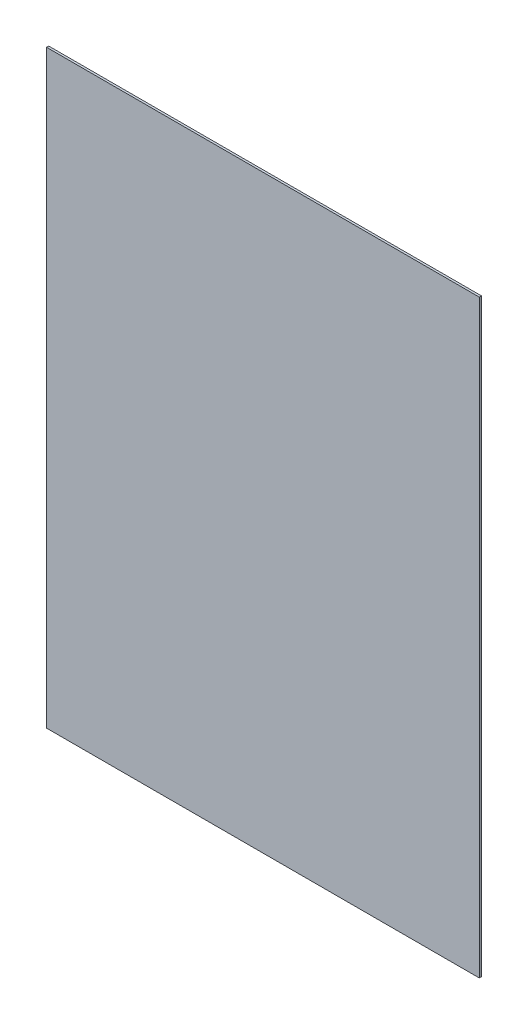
ISO-10303-21;
HEADER;
FILE_DESCRIPTION(('STEP AP214'),'2;1');
FILE_NAME('part.step','',(''),(''),'','','');
FILE_SCHEMA(('AUTOMOTIVE_DESIGN { 1 0 10303 214 1 1 1 1 }'));
ENDSEC;
DATA;
#1=APPLICATION_CONTEXT('core data for automotive mechanical design processes');
#2=APPLICATION_PROTOCOL_DEFINITION('international standard','automotive_design',2000,#1);
#3=PRODUCT_CONTEXT('',#1,'mechanical');
#4=PRODUCT('Part','Part','',(#3));
#5=PRODUCT_RELATED_PRODUCT_CATEGORY('part','',(#4));
#6=PRODUCT_DEFINITION_FORMATION('','',#4);
#7=PRODUCT_DEFINITION_CONTEXT('part definition',#1,'design');
#8=PRODUCT_DEFINITION('design','',#6,#7);
#9=PRODUCT_DEFINITION_SHAPE('','',#8);
#10=(LENGTH_UNIT() NAMED_UNIT(*) SI_UNIT(.MILLI.,.METRE.));
#11=(NAMED_UNIT(*) PLANE_ANGLE_UNIT() SI_UNIT($,.RADIAN.));
#12=(NAMED_UNIT(*) SI_UNIT($,.STERADIAN.) SOLID_ANGLE_UNIT());
#13=UNCERTAINTY_MEASURE_WITH_UNIT(LENGTH_MEASURE(1.E-05),#10,'distance_accuracy_value','');
#14=(GEOMETRIC_REPRESENTATION_CONTEXT(3) GLOBAL_UNCERTAINTY_ASSIGNED_CONTEXT((#13)) GLOBAL_UNIT_ASSIGNED_CONTEXT((#10,
#11,#12)) REPRESENTATION_CONTEXT('',''));
#15=CARTESIAN_POINT('',(0.,0.,0.));
#16=DIRECTION('',(0.,0.,1.));
#17=DIRECTION('',(1.,0.,0.));
#18=AXIS2_PLACEMENT_3D('',#15,#16,#17);
#19=CARTESIAN_POINT('',(0.,0.,4.));
#20=DIRECTION('',(1.,0.,0.));
#21=DIRECTION('',(0.,0.,-1.));
#22=AXIS2_PLACEMENT_3D('',#19,#20,#21);
#23=PLANE('',#22);
#24=DIRECTION('',(0.,-1.,0.));
#25=VECTOR('',#24,1.);
#26=CARTESIAN_POINT('',(0.,0.,0.));
#27=LINE('',#26,#25);
#28=CARTESIAN_POINT('',(0.,1090.,0.));
#29=VERTEX_POINT('',#28);
#30=CARTESIAN_POINT('',(0.,0.,0.));
#31=VERTEX_POINT('',#30);
#32=EDGE_CURVE('E96',#29,#31,#27,.T.);
#33=ORIENTED_EDGE('',*,*,#32,.T.);
#34=DIRECTION('',(0.,0.,-1.));
#35=VECTOR('',#34,1.);
#36=CARTESIAN_POINT('',(0.,0.,4.));
#37=LINE('',#36,#35);
#38=CARTESIAN_POINT('',(0.,0.,4.));
#39=VERTEX_POINT('',#38);
#40=EDGE_CURVE('E11',#39,#31,#37,.T.);
#41=ORIENTED_EDGE('',*,*,#40,.F.);
#42=DIRECTION('',(0.,-1.,0.));
#43=VECTOR('',#42,1.);
#44=CARTESIAN_POINT('',(0.,0.,4.));
#45=LINE('',#44,#43);
#46=CARTESIAN_POINT('',(0.,1090.,4.));
#47=VERTEX_POINT('',#46);
#48=EDGE_CURVE('E84',#47,#39,#45,.T.);
#49=ORIENTED_EDGE('',*,*,#48,.F.);
#50=DIRECTION('',(0.,0.,-1.));
#51=VECTOR('',#50,1.);
#52=CARTESIAN_POINT('',(0.,1090.,4.));
#53=LINE('',#52,#51);
#54=EDGE_CURVE('E92',#47,#29,#53,.T.);
#55=ORIENTED_EDGE('',*,*,#54,.T.);
#56=EDGE_LOOP('',(#33,#41,#49,#55));
#57=FACE_BOUND('',#56,.T.);
#58=ADVANCED_FACE('F33',(#57),#23,.F.);
#59=CARTESIAN_POINT('',(0.,0.,4.));
#60=DIRECTION('',(0.,1.,0.));
#61=DIRECTION('',(0.,0.,1.));
#62=AXIS2_PLACEMENT_3D('',#59,#60,#61);
#63=PLANE('',#62);
#64=DIRECTION('',(1.,0.,0.));
#65=VECTOR('',#64,1.);
#66=CARTESIAN_POINT('',(0.,0.,0.));
#67=LINE('',#66,#65);
#68=CARTESIAN_POINT('',(800.,0.,0.));
#69=VERTEX_POINT('',#68);
#70=EDGE_CURVE('E88',#31,#69,#67,.T.);
#71=ORIENTED_EDGE('',*,*,#70,.T.);
#72=DIRECTION('',(0.,0.,-1.));
#73=VECTOR('',#72,1.);
#74=CARTESIAN_POINT('',(800.,0.,4.));
#75=LINE('',#74,#73);
#76=CARTESIAN_POINT('',(800.,0.,4.));
#77=VERTEX_POINT('',#76);
#78=EDGE_CURVE('E41',#77,#69,#75,.T.);
#79=ORIENTED_EDGE('',*,*,#78,.F.);
#80=DIRECTION('',(1.,0.,0.));
#81=VECTOR('',#80,1.);
#82=CARTESIAN_POINT('',(0.,0.,4.));
#83=LINE('',#82,#81);
#84=EDGE_CURVE('E79',#39,#77,#83,.T.);
#85=ORIENTED_EDGE('',*,*,#84,.F.);
#86=ORIENTED_EDGE('',*,*,#40,.T.);
#87=EDGE_LOOP('',(#71,#79,#85,#86));
#88=FACE_BOUND('',#87,.T.);
#89=ADVANCED_FACE('F87',(#88),#63,.F.);
#90=CARTESIAN_POINT('',(800.,0.,4.));
#91=DIRECTION('',(-1.,0.,0.));
#92=DIRECTION('',(0.,0.,1.));
#93=AXIS2_PLACEMENT_3D('',#90,#91,#92);
#94=PLANE('',#93);
#95=DIRECTION('',(0.,1.,0.));
#96=VECTOR('',#95,1.);
#97=CARTESIAN_POINT('',(800.,0.,0.));
#98=LINE('',#97,#96);
#99=CARTESIAN_POINT('',(800.,1090.,0.));
#100=VERTEX_POINT('',#99);
#101=EDGE_CURVE('E66',#69,#100,#98,.T.);
#102=ORIENTED_EDGE('',*,*,#101,.T.);
#103=DIRECTION('',(0.,0.,-1.));
#104=VECTOR('',#103,1.);
#105=CARTESIAN_POINT('',(800.,1090.,4.));
#106=LINE('',#105,#104);
#107=CARTESIAN_POINT('',(800.,1090.,4.));
#108=VERTEX_POINT('',#107);
#109=EDGE_CURVE('E89',#108,#100,#106,.T.);
#110=ORIENTED_EDGE('',*,*,#109,.F.);
#111=DIRECTION('',(0.,1.,0.));
#112=VECTOR('',#111,1.);
#113=CARTESIAN_POINT('',(800.,0.,4.));
#114=LINE('',#113,#112);
#115=EDGE_CURVE('E82',#77,#108,#114,.T.);
#116=ORIENTED_EDGE('',*,*,#115,.F.);
#117=ORIENTED_EDGE('',*,*,#78,.T.);
#118=EDGE_LOOP('',(#102,#110,#116,#117));
#119=FACE_BOUND('',#118,.T.);
#120=ADVANCED_FACE('F90',(#119),#94,.F.);
#121=CARTESIAN_POINT('',(0.,1090.,4.));
#122=DIRECTION('',(0.,-1.,0.));
#123=DIRECTION('',(0.,0.,-1.));
#124=AXIS2_PLACEMENT_3D('',#121,#122,#123);
#125=PLANE('',#124);
#126=DIRECTION('',(-1.,0.,0.));
#127=VECTOR('',#126,1.);
#128=CARTESIAN_POINT('',(0.,1090.,0.));
#129=LINE('',#128,#127);
#130=EDGE_CURVE('E72',#100,#29,#129,.T.);
#131=ORIENTED_EDGE('',*,*,#130,.T.);
#132=ORIENTED_EDGE('',*,*,#54,.F.);
#133=DIRECTION('',(-1.,0.,0.));
#134=VECTOR('',#133,1.);
#135=CARTESIAN_POINT('',(0.,1090.,4.));
#136=LINE('',#135,#134);
#137=EDGE_CURVE('E49',#108,#47,#136,.T.);
#138=ORIENTED_EDGE('',*,*,#137,.F.);
#139=ORIENTED_EDGE('',*,*,#109,.T.);
#140=EDGE_LOOP('',(#131,#132,#138,#139));
#141=FACE_BOUND('',#140,.T.);
#142=ADVANCED_FACE('F103',(#141),#125,.F.);
#143=CARTESIAN_POINT('',(0.,0.,4.));
#144=DIRECTION('',(0.,0.,-1.));
#145=DIRECTION('',(-1.,0.,0.));
#146=AXIS2_PLACEMENT_3D('',#143,#144,#145);
#147=PLANE('',#146);
#148=ORIENTED_EDGE('',*,*,#48,.T.);
#149=ORIENTED_EDGE('',*,*,#84,.T.);
#150=ORIENTED_EDGE('',*,*,#115,.T.);
#151=ORIENTED_EDGE('',*,*,#137,.T.);
#152=EDGE_LOOP('',(#148,#149,#150,#151));
#153=FACE_BOUND('',#152,.T.);
#154=ADVANCED_FACE('F80',(#153),#147,.F.);
#155=CARTESIAN_POINT('',(0.,0.,0.));
#156=DIRECTION('',(0.,0.,-1.));
#157=DIRECTION('',(-1.,0.,0.));
#158=AXIS2_PLACEMENT_3D('',#155,#156,#157);
#159=PLANE('',#158);
#160=ORIENTED_EDGE('',*,*,#32,.F.);
#161=ORIENTED_EDGE('',*,*,#130,.F.);
#162=ORIENTED_EDGE('',*,*,#101,.F.);
#163=ORIENTED_EDGE('',*,*,#70,.F.);
#164=EDGE_LOOP('',(#160,#161,#162,#163));
#165=FACE_BOUND('',#164,.T.);
#166=ADVANCED_FACE('F106',(#165),#159,.T.);
#167=CLOSED_SHELL('',(#58,#89,#120,#142,#154,#166));
#168=MANIFOLD_SOLID_BREP('B2',#167);
#169=ADVANCED_BREP_SHAPE_REPRESENTATION('',(#18,#168),#14);
#170=SHAPE_DEFINITION_REPRESENTATION(#9,#169);
ENDSEC;
END-ISO-10303-21;
